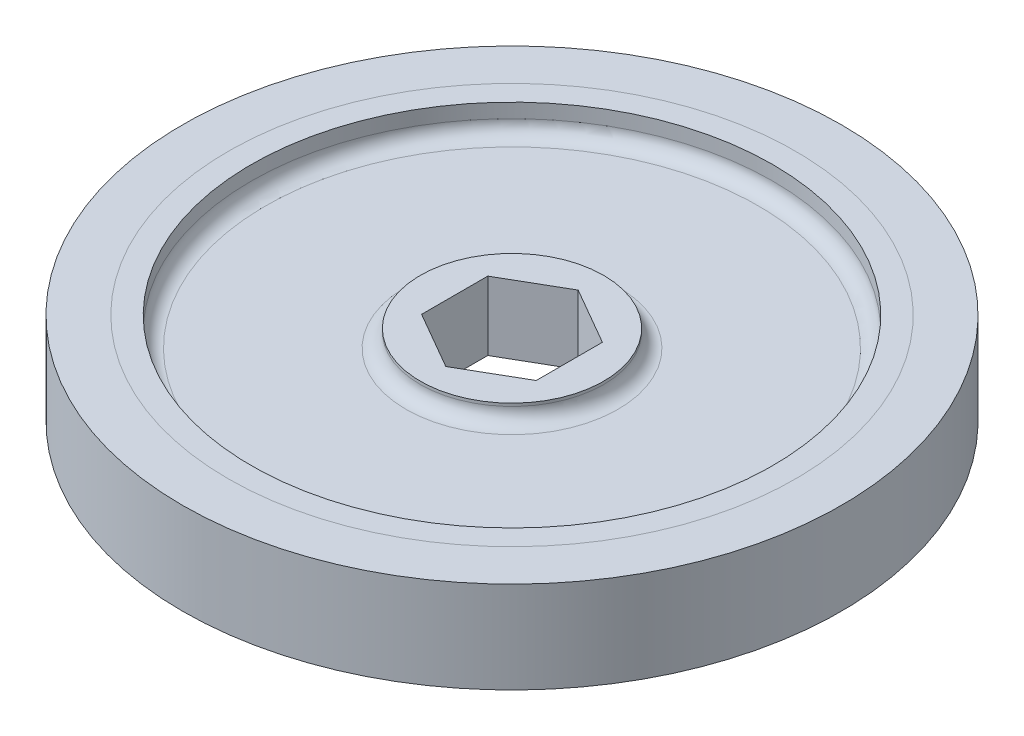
ISO-10303-21;
HEADER;
FILE_DESCRIPTION(('STEP AP214'),'2;1');
FILE_NAME('part.step','',(''),(''),'','','');
FILE_SCHEMA(('AUTOMOTIVE_DESIGN { 1 0 10303 214 1 1 1 1 }'));
ENDSEC;
DATA;
#1=APPLICATION_CONTEXT('core data for automotive mechanical design processes');
#2=APPLICATION_PROTOCOL_DEFINITION('international standard','automotive_design',2000,#1);
#3=PRODUCT_CONTEXT('',#1,'mechanical');
#4=PRODUCT('Part','Part','',(#3));
#5=PRODUCT_RELATED_PRODUCT_CATEGORY('part','',(#4));
#6=PRODUCT_DEFINITION_FORMATION('','',#4);
#7=PRODUCT_DEFINITION_CONTEXT('part definition',#1,'design');
#8=PRODUCT_DEFINITION('design','',#6,#7);
#9=PRODUCT_DEFINITION_SHAPE('','',#8);
#10=(LENGTH_UNIT() NAMED_UNIT(*) SI_UNIT(.MILLI.,.METRE.));
#11=(NAMED_UNIT(*) PLANE_ANGLE_UNIT() SI_UNIT($,.RADIAN.));
#12=(NAMED_UNIT(*) SI_UNIT($,.STERADIAN.) SOLID_ANGLE_UNIT());
#13=UNCERTAINTY_MEASURE_WITH_UNIT(LENGTH_MEASURE(1.E-05),#10,'distance_accuracy_value','');
#14=(GEOMETRIC_REPRESENTATION_CONTEXT(3) GLOBAL_UNCERTAINTY_ASSIGNED_CONTEXT((#13)) GLOBAL_UNIT_ASSIGNED_CONTEXT((#10,
#11,#12)) REPRESENTATION_CONTEXT('',''));
#15=CARTESIAN_POINT('',(0.,0.,0.));
#16=DIRECTION('',(0.,0.,1.));
#17=DIRECTION('',(1.,0.,0.));
#18=AXIS2_PLACEMENT_3D('',#15,#16,#17);
#19=CARTESIAN_POINT('',(28.8925,1.27,0.));
#20=DIRECTION('',(0.,1.,0.));
#21=DIRECTION('',(0.,0.,1.));
#22=AXIS2_PLACEMENT_3D('',#19,#20,#21);
#23=PLANE('',#22);
#24=CARTESIAN_POINT('',(0.,1.27,0.));
#25=DIRECTION('',(0.,-1.,0.));
#26=DIRECTION('',(0.,0.,-1.));
#27=AXIS2_PLACEMENT_3D('',#24,#25,#26);
#28=CIRCLE('',#27,36.5125);
#29=CARTESIAN_POINT('',(0.,1.27,-36.5125));
#30=VERTEX_POINT('',#29);
#31=EDGE_CURVE('E149',#30,#30,#28,.T.);
#32=ORIENTED_EDGE('',*,*,#31,.F.);
#33=EDGE_LOOP('',(#32));
#34=FACE_BOUND('',#33,.T.);
#35=CARTESIAN_POINT('',(0.,1.27,0.));
#36=DIRECTION('',(0.,1.,0.));
#37=DIRECTION('',(0.,0.,1.));
#38=AXIS2_PLACEMENT_3D('',#35,#36,#37);
#39=CIRCLE('',#38,31.4325);
#40=CARTESIAN_POINT('',(0.,1.27,31.4325));
#41=VERTEX_POINT('',#40);
#42=EDGE_CURVE('E11',#41,#41,#39,.F.);
#43=ORIENTED_EDGE('',*,*,#42,.T.);
#44=EDGE_LOOP('',(#43));
#45=FACE_BOUND('',#44,.T.);
#46=ADVANCED_FACE('F39',(#34,#45),#23,.T.);
#47=CARTESIAN_POINT('',(28.8925,-8.89,0.));
#48=DIRECTION('',(0.,-1.,0.));
#49=DIRECTION('',(0.,0.,-1.));
#50=AXIS2_PLACEMENT_3D('',#47,#48,#49);
#51=PLANE('',#50);
#52=CARTESIAN_POINT('',(0.,-8.89,0.));
#53=DIRECTION('',(0.,-1.,0.));
#54=DIRECTION('',(0.,0.,-1.));
#55=AXIS2_PLACEMENT_3D('',#52,#53,#54);
#56=CIRCLE('',#55,36.5125);
#57=CARTESIAN_POINT('',(0.,-8.89,-36.5125));
#58=VERTEX_POINT('',#57);
#59=EDGE_CURVE('E152',#58,#58,#56,.T.);
#60=ORIENTED_EDGE('',*,*,#59,.T.);
#61=EDGE_LOOP('',(#60));
#62=FACE_BOUND('',#61,.T.);
#63=CARTESIAN_POINT('',(0.,-8.89,0.));
#64=DIRECTION('',(0.,-1.,0.));
#65=DIRECTION('',(0.,0.,-1.));
#66=AXIS2_PLACEMENT_3D('',#63,#64,#65);
#67=CIRCLE('',#66,31.4325);
#68=CARTESIAN_POINT('',(0.,-8.89,-31.4325));
#69=VERTEX_POINT('',#68);
#70=EDGE_CURVE('E43',#69,#69,#67,.F.);
#71=ORIENTED_EDGE('',*,*,#70,.T.);
#72=EDGE_LOOP('',(#71));
#73=FACE_BOUND('',#72,.T.);
#74=ADVANCED_FACE('F192',(#62,#73),#51,.T.);
#75=CARTESIAN_POINT('',(0.,-7.62,0.));
#76=DIRECTION('',(0.,-1.,0.));
#77=DIRECTION('',(0.,0.,-1.));
#78=AXIS2_PLACEMENT_3D('',#75,#76,#77);
#79=PLANE('',#78);
#80=DIRECTION('',(0.866025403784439,0.,0.5));
#81=VECTOR('',#80,1.);
#82=CARTESIAN_POINT('',(3.175,-7.62,-5.49926131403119));
#83=LINE('',#82,#81);
#84=CARTESIAN_POINT('',(0.,-7.62,-7.33234841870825));
#85=VERTEX_POINT('',#84);
#86=CARTESIAN_POINT('',(6.35,-7.62,-3.66617420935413));
#87=VERTEX_POINT('',#86);
#88=EDGE_CURVE('E141',#85,#87,#83,.T.);
#89=ORIENTED_EDGE('',*,*,#88,.F.);
#90=DIRECTION('',(0.866025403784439,0.,-0.5));
#91=VECTOR('',#90,1.);
#92=CARTESIAN_POINT('',(-3.175,-7.62,-5.49926131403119));
#93=LINE('',#92,#91);
#94=CARTESIAN_POINT('',(-6.35,-7.62,-3.66617420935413));
#95=VERTEX_POINT('',#94);
#96=EDGE_CURVE('E126',#95,#85,#93,.T.);
#97=ORIENTED_EDGE('',*,*,#96,.F.);
#98=DIRECTION('',(0.,0.,-1.));
#99=VECTOR('',#98,1.);
#100=CARTESIAN_POINT('',(-6.35,-7.62,0.));
#101=LINE('',#100,#99);
#102=CARTESIAN_POINT('',(-6.35,-7.62,3.66617420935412));
#103=VERTEX_POINT('',#102);
#104=EDGE_CURVE('E99',#103,#95,#101,.T.);
#105=ORIENTED_EDGE('',*,*,#104,.F.);
#106=DIRECTION('',(-0.866025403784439,0.,-0.5));
#107=VECTOR('',#106,1.);
#108=CARTESIAN_POINT('',(-3.175,-7.62,5.49926131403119));
#109=LINE('',#108,#107);
#110=CARTESIAN_POINT('',(0.,-7.62,7.33234841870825));
#111=VERTEX_POINT('',#110);
#112=EDGE_CURVE('E135',#111,#103,#109,.T.);
#113=ORIENTED_EDGE('',*,*,#112,.F.);
#114=DIRECTION('',(-0.866025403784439,0.,0.5));
#115=VECTOR('',#114,1.);
#116=CARTESIAN_POINT('',(3.175,-7.62,5.49926131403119));
#117=LINE('',#116,#115);
#118=CARTESIAN_POINT('',(6.35,-7.62,3.66617420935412));
#119=VERTEX_POINT('',#118);
#120=EDGE_CURVE('E137',#119,#111,#117,.T.);
#121=ORIENTED_EDGE('',*,*,#120,.F.);
#122=DIRECTION('',(0.,0.,1.));
#123=VECTOR('',#122,1.);
#124=CARTESIAN_POINT('',(6.35,-7.62,0.));
#125=LINE('',#124,#123);
#126=EDGE_CURVE('E139',#87,#119,#125,.T.);
#127=ORIENTED_EDGE('',*,*,#126,.F.);
#128=EDGE_LOOP('',(#89,#97,#105,#113,#121,#127));
#129=FACE_BOUND('',#128,.T.);
#130=CARTESIAN_POINT('',(0.,-7.62,0.));
#131=DIRECTION('',(0.,-1.,0.));
#132=DIRECTION('',(0.,0.,-1.));
#133=AXIS2_PLACEMENT_3D('',#130,#131,#132);
#134=CIRCLE('',#133,10.16);
#135=CARTESIAN_POINT('',(0.,-7.62,-10.16));
#136=VERTEX_POINT('',#135);
#137=EDGE_CURVE('E158',#136,#136,#134,.T.);
#138=ORIENTED_EDGE('',*,*,#137,.T.);
#139=EDGE_LOOP('',(#138));
#140=FACE_BOUND('',#139,.T.);
#141=ADVANCED_FACE('F219',(#129,#140),#79,.T.);
#142=CARTESIAN_POINT('',(0.,-7.62000000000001,0.));
#143=DIRECTION('',(0.,-1.,0.));
#144=DIRECTION('',(0.,0.,-1.));
#145=AXIS2_PLACEMENT_3D('',#142,#143,#144);
#146=CYLINDRICAL_SURFACE('',#145,10.16);
#147=CARTESIAN_POINT('',(0.,-7.3025,0.));
#148=DIRECTION('',(0.,-1.,0.));
#149=DIRECTION('',(0.,0.,-1.));
#150=AXIS2_PLACEMENT_3D('',#147,#148,#149);
#151=CIRCLE('',#150,10.16);
#152=CARTESIAN_POINT('',(0.,-7.3025,-10.16));
#153=VERTEX_POINT('',#152);
#154=EDGE_CURVE('E170',#153,#153,#151,.T.);
#155=ORIENTED_EDGE('',*,*,#154,.T.);
#156=EDGE_LOOP('',(#155));
#157=FACE_BOUND('',#156,.T.);
#158=ORIENTED_EDGE('',*,*,#137,.F.);
#159=EDGE_LOOP('',(#158));
#160=FACE_BOUND('',#159,.T.);
#161=ADVANCED_FACE('F209',(#157,#160),#146,.T.);
#162=CARTESIAN_POINT('',(10.16,-5.715,0.));
#163=DIRECTION('',(0.,-1.,0.));
#164=DIRECTION('',(0.,0.,-1.));
#165=AXIS2_PLACEMENT_3D('',#162,#163,#164);
#166=PLANE('',#165);
#167=CARTESIAN_POINT('',(0.,-5.715,0.));
#168=DIRECTION('',(0.,-1.,0.));
#169=DIRECTION('',(0.,0.,-1.));
#170=AXIS2_PLACEMENT_3D('',#167,#168,#169);
#171=CIRCLE('',#170,27.305);
#172=CARTESIAN_POINT('',(0.,-5.715,-27.305));
#173=VERTEX_POINT('',#172);
#174=EDGE_CURVE('E164',#173,#173,#171,.T.);
#175=ORIENTED_EDGE('',*,*,#174,.T.);
#176=EDGE_LOOP('',(#175));
#177=FACE_BOUND('',#176,.T.);
#178=CARTESIAN_POINT('',(0.,-5.715,0.));
#179=DIRECTION('',(0.,-1.,0.));
#180=DIRECTION('',(0.,0.,-1.));
#181=AXIS2_PLACEMENT_3D('',#178,#179,#180);
#182=CIRCLE('',#181,11.7475);
#183=CARTESIAN_POINT('',(0.,-5.715,-11.7475));
#184=VERTEX_POINT('',#183);
#185=EDGE_CURVE('E161',#184,#184,#182,.F.);
#186=ORIENTED_EDGE('',*,*,#185,.T.);
#187=EDGE_LOOP('',(#186));
#188=FACE_BOUND('',#187,.T.);
#189=ADVANCED_FACE('F203',(#177,#188),#166,.T.);
#190=CARTESIAN_POINT('',(0.,-7.62000000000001,0.));
#191=DIRECTION('',(0.,-1.,0.));
#192=DIRECTION('',(0.,0.,-1.));
#193=AXIS2_PLACEMENT_3D('',#190,#191,#192);
#194=CYLINDRICAL_SURFACE('',#193,28.8925);
#195=CARTESIAN_POINT('',(0.,-7.3025,0.));
#196=DIRECTION('',(0.,-1.,0.));
#197=DIRECTION('',(0.,0.,-1.));
#198=AXIS2_PLACEMENT_3D('',#195,#196,#197);
#199=CIRCLE('',#198,28.8925);
#200=CARTESIAN_POINT('',(0.,-7.3025,-28.8925));
#201=VERTEX_POINT('',#200);
#202=EDGE_CURVE('E167',#201,#201,#199,.F.);
#203=ORIENTED_EDGE('',*,*,#202,.T.);
#204=EDGE_LOOP('',(#203));
#205=FACE_BOUND('',#204,.T.);
#206=CARTESIAN_POINT('',(0.,-8.89,0.));
#207=DIRECTION('',(0.,-1.,0.));
#208=DIRECTION('',(0.,0.,-1.));
#209=AXIS2_PLACEMENT_3D('',#206,#207,#208);
#210=CIRCLE('',#209,28.8925);
#211=CARTESIAN_POINT('',(0.,-8.89,-28.8925));
#212=VERTEX_POINT('',#211);
#213=EDGE_CURVE('E155',#212,#212,#210,.T.);
#214=ORIENTED_EDGE('',*,*,#213,.T.);
#215=EDGE_LOOP('',(#214));
#216=FACE_BOUND('',#215,.T.);
#217=ADVANCED_FACE('F198',(#205,#216),#194,.F.);
#218=ORIENTED_EDGE('',*,*,#70,.F.);
#219=EDGE_LOOP('',(#218));
#220=FACE_BOUND('',#219,.T.);
#221=ORIENTED_EDGE('',*,*,#213,.F.);
#222=EDGE_LOOP('',(#221));
#223=FACE_BOUND('',#222,.T.);
#224=ADVANCED_FACE('F194',(#220,#223),#51,.T.);
#225=CARTESIAN_POINT('',(0.,-7.62000000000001,0.));
#226=DIRECTION('',(0.,-1.,0.));
#227=DIRECTION('',(0.,0.,-1.));
#228=AXIS2_PLACEMENT_3D('',#225,#226,#227);
#229=CYLINDRICAL_SURFACE('',#228,36.5125);
#230=ORIENTED_EDGE('',*,*,#31,.T.);
#231=EDGE_LOOP('',(#230));
#232=FACE_BOUND('',#231,.T.);
#233=ORIENTED_EDGE('',*,*,#59,.F.);
#234=EDGE_LOOP('',(#233));
#235=FACE_BOUND('',#234,.T.);
#236=ADVANCED_FACE('F197',(#232,#235),#229,.T.);
#237=ORIENTED_EDGE('',*,*,#42,.F.);
#238=EDGE_LOOP('',(#237));
#239=FACE_BOUND('',#238,.T.);
#240=CARTESIAN_POINT('',(0.,1.27,0.));
#241=DIRECTION('',(0.,-1.,0.));
#242=DIRECTION('',(0.,0.,-1.));
#243=AXIS2_PLACEMENT_3D('',#240,#241,#242);
#244=CIRCLE('',#243,28.8925);
#245=CARTESIAN_POINT('',(0.,1.27,-28.8925));
#246=VERTEX_POINT('',#245);
#247=EDGE_CURVE('E146',#246,#246,#244,.T.);
#248=ORIENTED_EDGE('',*,*,#247,.T.);
#249=EDGE_LOOP('',(#248));
#250=FACE_BOUND('',#249,.T.);
#251=ADVANCED_FACE('F215',(#239,#250),#23,.T.);
#252=CARTESIAN_POINT('',(0.,-7.62000000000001,0.));
#253=DIRECTION('',(0.,-1.,0.));
#254=DIRECTION('',(0.,0.,-1.));
#255=AXIS2_PLACEMENT_3D('',#252,#253,#254);
#256=CYLINDRICAL_SURFACE('',#255,28.8925);
#257=CARTESIAN_POINT('',(0.,-0.317500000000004,0.));
#258=DIRECTION('',(0.,1.,0.));
#259=DIRECTION('',(0.,0.,1.));
#260=AXIS2_PLACEMENT_3D('',#257,#258,#259);
#261=CIRCLE('',#260,28.8925);
#262=CARTESIAN_POINT('',(0.,-0.317500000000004,28.8925));
#263=VERTEX_POINT('',#262);
#264=EDGE_CURVE('E173',#263,#263,#261,.F.);
#265=ORIENTED_EDGE('',*,*,#264,.T.);
#266=EDGE_LOOP('',(#265));
#267=FACE_BOUND('',#266,.T.);
#268=ORIENTED_EDGE('',*,*,#247,.F.);
#269=EDGE_LOOP('',(#268));
#270=FACE_BOUND('',#269,.T.);
#271=ADVANCED_FACE('F226',(#267,#270),#256,.F.);
#272=CARTESIAN_POINT('',(10.16,-1.905,0.));
#273=DIRECTION('',(0.,1.,0.));
#274=DIRECTION('',(0.,0.,1.));
#275=AXIS2_PLACEMENT_3D('',#272,#273,#274);
#276=PLANE('',#275);
#277=CARTESIAN_POINT('',(0.,-1.905,0.));
#278=DIRECTION('',(0.,1.,0.));
#279=DIRECTION('',(0.,0.,1.));
#280=AXIS2_PLACEMENT_3D('',#277,#278,#279);
#281=CIRCLE('',#280,27.305);
#282=CARTESIAN_POINT('',(0.,-1.905,27.305));
#283=VERTEX_POINT('',#282);
#284=EDGE_CURVE('E179',#283,#283,#281,.T.);
#285=ORIENTED_EDGE('',*,*,#284,.T.);
#286=EDGE_LOOP('',(#285));
#287=FACE_BOUND('',#286,.T.);
#288=CARTESIAN_POINT('',(0.,-1.905,0.));
#289=DIRECTION('',(0.,1.,0.));
#290=DIRECTION('',(0.,0.,1.));
#291=AXIS2_PLACEMENT_3D('',#288,#289,#290);
#292=CIRCLE('',#291,11.7475);
#293=CARTESIAN_POINT('',(0.,-1.905,11.7475));
#294=VERTEX_POINT('',#293);
#295=EDGE_CURVE('E176',#294,#294,#292,.F.);
#296=ORIENTED_EDGE('',*,*,#295,.T.);
#297=EDGE_LOOP('',(#296));
#298=FACE_BOUND('',#297,.T.);
#299=ADVANCED_FACE('F232',(#287,#298),#276,.T.);
#300=CARTESIAN_POINT('',(0.,-7.62000000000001,0.));
#301=DIRECTION('',(0.,-1.,0.));
#302=DIRECTION('',(0.,0.,-1.));
#303=AXIS2_PLACEMENT_3D('',#300,#301,#302);
#304=CYLINDRICAL_SURFACE('',#303,10.16);
#305=CARTESIAN_POINT('',(0.,-0.317500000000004,0.));
#306=DIRECTION('',(0.,1.,0.));
#307=DIRECTION('',(0.,0.,1.));
#308=AXIS2_PLACEMENT_3D('',#305,#306,#307);
#309=CIRCLE('',#308,10.16);
#310=CARTESIAN_POINT('',(0.,-0.317500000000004,10.16));
#311=VERTEX_POINT('',#310);
#312=EDGE_CURVE('E182',#311,#311,#309,.T.);
#313=ORIENTED_EDGE('',*,*,#312,.T.);
#314=EDGE_LOOP('',(#313));
#315=FACE_BOUND('',#314,.T.);
#316=CARTESIAN_POINT('',(0.,0.,0.));
#317=DIRECTION('',(0.,-1.,0.));
#318=DIRECTION('',(0.,0.,-1.));
#319=AXIS2_PLACEMENT_3D('',#316,#317,#318);
#320=CIRCLE('',#319,10.16);
#321=CARTESIAN_POINT('',(0.,0.,-10.16));
#322=VERTEX_POINT('',#321);
#323=EDGE_CURVE('E143',#322,#322,#320,.T.);
#324=ORIENTED_EDGE('',*,*,#323,.T.);
#325=EDGE_LOOP('',(#324));
#326=FACE_BOUND('',#325,.T.);
#327=ADVANCED_FACE('F312',(#315,#326),#304,.T.);
#328=CARTESIAN_POINT('',(0.,0.,0.));
#329=DIRECTION('',(0.,1.,0.));
#330=DIRECTION('',(0.,0.,1.));
#331=AXIS2_PLACEMENT_3D('',#328,#329,#330);
#332=PLANE('',#331);
#333=DIRECTION('',(-0.866025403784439,0.,-0.5));
#334=VECTOR('',#333,1.);
#335=CARTESIAN_POINT('',(6.35,0.,-3.66617420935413));
#336=LINE('',#335,#334);
#337=CARTESIAN_POINT('',(6.35,0.,-3.66617420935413));
#338=VERTEX_POINT('',#337);
#339=CARTESIAN_POINT('',(0.,0.,-7.33234841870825));
#340=VERTEX_POINT('',#339);
#341=EDGE_CURVE('E63',#338,#340,#336,.T.);
#342=ORIENTED_EDGE('',*,*,#341,.F.);
#343=DIRECTION('',(0.,0.,-1.));
#344=VECTOR('',#343,1.);
#345=CARTESIAN_POINT('',(6.35,0.,3.66617420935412));
#346=LINE('',#345,#344);
#347=CARTESIAN_POINT('',(6.35,0.,3.66617420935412));
#348=VERTEX_POINT('',#347);
#349=EDGE_CURVE('E121',#348,#338,#346,.T.);
#350=ORIENTED_EDGE('',*,*,#349,.F.);
#351=DIRECTION('',(0.866025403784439,0.,-0.5));
#352=VECTOR('',#351,1.);
#353=CARTESIAN_POINT('',(0.,0.,7.33234841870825));
#354=LINE('',#353,#352);
#355=CARTESIAN_POINT('',(0.,0.,7.33234841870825));
#356=VERTEX_POINT('',#355);
#357=EDGE_CURVE('E115',#356,#348,#354,.T.);
#358=ORIENTED_EDGE('',*,*,#357,.F.);
#359=DIRECTION('',(0.866025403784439,0.,0.5));
#360=VECTOR('',#359,1.);
#361=CARTESIAN_POINT('',(-6.35,0.,3.66617420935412));
#362=LINE('',#361,#360);
#363=CARTESIAN_POINT('',(-6.35,0.,3.66617420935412));
#364=VERTEX_POINT('',#363);
#365=EDGE_CURVE('E113',#364,#356,#362,.T.);
#366=ORIENTED_EDGE('',*,*,#365,.F.);
#367=DIRECTION('',(0.,0.,1.));
#368=VECTOR('',#367,1.);
#369=CARTESIAN_POINT('',(-6.35,0.,-3.66617420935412));
#370=LINE('',#369,#368);
#371=CARTESIAN_POINT('',(-6.35,0.,-3.66617420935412));
#372=VERTEX_POINT('',#371);
#373=EDGE_CURVE('E96',#372,#364,#370,.T.);
#374=ORIENTED_EDGE('',*,*,#373,.F.);
#375=DIRECTION('',(-0.866025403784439,0.,0.5));
#376=VECTOR('',#375,1.);
#377=CARTESIAN_POINT('',(0.,0.,-7.33234841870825));
#378=LINE('',#377,#376);
#379=EDGE_CURVE('E105',#340,#372,#378,.T.);
#380=ORIENTED_EDGE('',*,*,#379,.F.);
#381=EDGE_LOOP('',(#342,#350,#358,#366,#374,#380));
#382=FACE_BOUND('',#381,.T.);
#383=ORIENTED_EDGE('',*,*,#323,.F.);
#384=EDGE_LOOP('',(#383));
#385=FACE_BOUND('',#384,.T.);
#386=ADVANCED_FACE('F109',(#382,#385),#332,.T.);
#387=CARTESIAN_POINT('',(6.35,-8.89,-3.66617420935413));
#388=DIRECTION('',(0.5,0.,-0.866025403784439));
#389=DIRECTION('',(-0.866025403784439,0.,-0.5));
#390=AXIS2_PLACEMENT_3D('',#387,#388,#389);
#391=PLANE('',#390);
#392=ORIENTED_EDGE('',*,*,#88,.T.);
#393=DIRECTION('',(0.,1.,0.));
#394=VECTOR('',#393,1.);
#395=CARTESIAN_POINT('',(6.35,-8.89,-3.66617420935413));
#396=LINE('',#395,#394);
#397=EDGE_CURVE('E124',#87,#338,#396,.T.);
#398=ORIENTED_EDGE('',*,*,#397,.T.);
#399=ORIENTED_EDGE('',*,*,#341,.T.);
#400=DIRECTION('',(0.,1.,0.));
#401=VECTOR('',#400,1.);
#402=CARTESIAN_POINT('',(0.,-8.89,-7.33234841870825));
#403=LINE('',#402,#401);
#404=EDGE_CURVE('E102',#85,#340,#403,.T.);
#405=ORIENTED_EDGE('',*,*,#404,.F.);
#406=EDGE_LOOP('',(#392,#398,#399,#405));
#407=FACE_BOUND('',#406,.T.);
#408=ADVANCED_FACE('F399',(#407),#391,.F.);
#409=CARTESIAN_POINT('',(6.35,-8.89,3.66617420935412));
#410=DIRECTION('',(1.,0.,0.));
#411=DIRECTION('',(0.,0.,-1.));
#412=AXIS2_PLACEMENT_3D('',#409,#410,#411);
#413=PLANE('',#412);
#414=ORIENTED_EDGE('',*,*,#126,.T.);
#415=DIRECTION('',(0.,1.,0.));
#416=VECTOR('',#415,1.);
#417=CARTESIAN_POINT('',(6.35,-8.89,3.66617420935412));
#418=LINE('',#417,#416);
#419=EDGE_CURVE('E127',#119,#348,#418,.T.);
#420=ORIENTED_EDGE('',*,*,#419,.T.);
#421=ORIENTED_EDGE('',*,*,#349,.T.);
#422=ORIENTED_EDGE('',*,*,#397,.F.);
#423=EDGE_LOOP('',(#414,#420,#421,#422));
#424=FACE_BOUND('',#423,.T.);
#425=ADVANCED_FACE('F389',(#424),#413,.F.);
#426=CARTESIAN_POINT('',(0.,-8.89,7.33234841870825));
#427=DIRECTION('',(0.5,0.,0.866025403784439));
#428=DIRECTION('',(0.866025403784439,0.,-0.5));
#429=AXIS2_PLACEMENT_3D('',#426,#427,#428);
#430=PLANE('',#429);
#431=ORIENTED_EDGE('',*,*,#120,.T.);
#432=DIRECTION('',(0.,1.,0.));
#433=VECTOR('',#432,1.);
#434=CARTESIAN_POINT('',(0.,-8.89,7.33234841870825));
#435=LINE('',#434,#433);
#436=EDGE_CURVE('E129',#111,#356,#435,.T.);
#437=ORIENTED_EDGE('',*,*,#436,.T.);
#438=ORIENTED_EDGE('',*,*,#357,.T.);
#439=ORIENTED_EDGE('',*,*,#419,.F.);
#440=EDGE_LOOP('',(#431,#437,#438,#439));
#441=FACE_BOUND('',#440,.T.);
#442=ADVANCED_FACE('F379',(#441),#430,.F.);
#443=CARTESIAN_POINT('',(-6.35,-8.89,3.66617420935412));
#444=DIRECTION('',(-0.5,0.,0.866025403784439));
#445=DIRECTION('',(0.866025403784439,0.,0.5));
#446=AXIS2_PLACEMENT_3D('',#443,#444,#445);
#447=PLANE('',#446);
#448=ORIENTED_EDGE('',*,*,#112,.T.);
#449=DIRECTION('',(0.,1.,0.));
#450=VECTOR('',#449,1.);
#451=CARTESIAN_POINT('',(-6.35,-8.89,3.66617420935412));
#452=LINE('',#451,#450);
#453=EDGE_CURVE('E101',#103,#364,#452,.T.);
#454=ORIENTED_EDGE('',*,*,#453,.T.);
#455=ORIENTED_EDGE('',*,*,#365,.T.);
#456=ORIENTED_EDGE('',*,*,#436,.F.);
#457=EDGE_LOOP('',(#448,#454,#455,#456));
#458=FACE_BOUND('',#457,.T.);
#459=ADVANCED_FACE('F370',(#458),#447,.F.);
#460=CARTESIAN_POINT('',(-6.35,-8.89,-3.66617420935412));
#461=DIRECTION('',(-1.,0.,0.));
#462=DIRECTION('',(0.,0.,1.));
#463=AXIS2_PLACEMENT_3D('',#460,#461,#462);
#464=PLANE('',#463);
#465=ORIENTED_EDGE('',*,*,#104,.T.);
#466=DIRECTION('',(0.,1.,0.));
#467=VECTOR('',#466,1.);
#468=CARTESIAN_POINT('',(-6.35,-8.89,-3.66617420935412));
#469=LINE('',#468,#467);
#470=EDGE_CURVE('E55',#95,#372,#469,.T.);
#471=ORIENTED_EDGE('',*,*,#470,.T.);
#472=ORIENTED_EDGE('',*,*,#373,.T.);
#473=ORIENTED_EDGE('',*,*,#453,.F.);
#474=EDGE_LOOP('',(#465,#471,#472,#473));
#475=FACE_BOUND('',#474,.T.);
#476=ADVANCED_FACE('F93',(#475),#464,.F.);
#477=CARTESIAN_POINT('',(0.,-8.89,-7.33234841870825));
#478=DIRECTION('',(-0.5,0.,-0.866025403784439));
#479=DIRECTION('',(-0.866025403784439,0.,0.5));
#480=AXIS2_PLACEMENT_3D('',#477,#478,#479);
#481=PLANE('',#480);
#482=ORIENTED_EDGE('',*,*,#96,.T.);
#483=ORIENTED_EDGE('',*,*,#404,.T.);
#484=ORIENTED_EDGE('',*,*,#379,.T.);
#485=ORIENTED_EDGE('',*,*,#470,.F.);
#486=EDGE_LOOP('',(#482,#483,#484,#485));
#487=FACE_BOUND('',#486,.T.);
#488=ADVANCED_FACE('F106',(#487),#481,.F.);
#489=CARTESIAN_POINT('',(0.,-7.3025,0.));
#490=DIRECTION('',(0.,-1.,0.));
#491=DIRECTION('',(0.,0.,-1.));
#492=AXIS2_PLACEMENT_3D('',#489,#490,#491);
#493=TOROIDAL_SURFACE('',#492,27.305,1.5875);
#494=ORIENTED_EDGE('',*,*,#202,.F.);
#495=EDGE_LOOP('',(#494));
#496=FACE_BOUND('',#495,.T.);
#497=ORIENTED_EDGE('',*,*,#174,.F.);
#498=EDGE_LOOP('',(#497));
#499=FACE_BOUND('',#498,.T.);
#500=ADVANCED_FACE('F295',(#496,#499),#493,.F.);
#501=CARTESIAN_POINT('',(0.,-7.3025,0.));
#502=DIRECTION('',(0.,-1.,0.));
#503=DIRECTION('',(0.,0.,-1.));
#504=AXIS2_PLACEMENT_3D('',#501,#502,#503);
#505=TOROIDAL_SURFACE('',#504,11.7475,1.5875);
#506=ORIENTED_EDGE('',*,*,#185,.F.);
#507=EDGE_LOOP('',(#506));
#508=FACE_BOUND('',#507,.T.);
#509=ORIENTED_EDGE('',*,*,#154,.F.);
#510=EDGE_LOOP('',(#509));
#511=FACE_BOUND('',#510,.T.);
#512=ADVANCED_FACE('F286',(#508,#511),#505,.F.);
#513=CARTESIAN_POINT('',(0.,-0.317500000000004,0.));
#514=DIRECTION('',(0.,1.,0.));
#515=DIRECTION('',(0.,0.,1.));
#516=AXIS2_PLACEMENT_3D('',#513,#514,#515);
#517=TOROIDAL_SURFACE('',#516,27.305,1.5875);
#518=ORIENTED_EDGE('',*,*,#284,.F.);
#519=EDGE_LOOP('',(#518));
#520=FACE_BOUND('',#519,.T.);
#521=ORIENTED_EDGE('',*,*,#264,.F.);
#522=EDGE_LOOP('',(#521));
#523=FACE_BOUND('',#522,.T.);
#524=ADVANCED_FACE('F277',(#520,#523),#517,.F.);
#525=CARTESIAN_POINT('',(0.,-0.317500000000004,0.));
#526=DIRECTION('',(0.,1.,0.));
#527=DIRECTION('',(0.,0.,1.));
#528=AXIS2_PLACEMENT_3D('',#525,#526,#527);
#529=TOROIDAL_SURFACE('',#528,11.7475,1.5875);
#530=ORIENTED_EDGE('',*,*,#312,.F.);
#531=EDGE_LOOP('',(#530));
#532=FACE_BOUND('',#531,.T.);
#533=ORIENTED_EDGE('',*,*,#295,.F.);
#534=EDGE_LOOP('',(#533));
#535=FACE_BOUND('',#534,.T.);
#536=ADVANCED_FACE('F41',(#532,#535),#529,.F.);
#537=CLOSED_SHELL('',(#46,#74,#141,#161,#189,#217,#224,#236,#251,#271,#299,#327,#386,#408,#425,
#442,#459,#476,#488,#500,#512,#524,#536));
#538=MANIFOLD_SOLID_BREP('B2',#537);
#539=ADVANCED_BREP_SHAPE_REPRESENTATION('',(#18,#538),#14);
#540=SHAPE_DEFINITION_REPRESENTATION(#9,#539);
ENDSEC;
END-ISO-10303-21;
